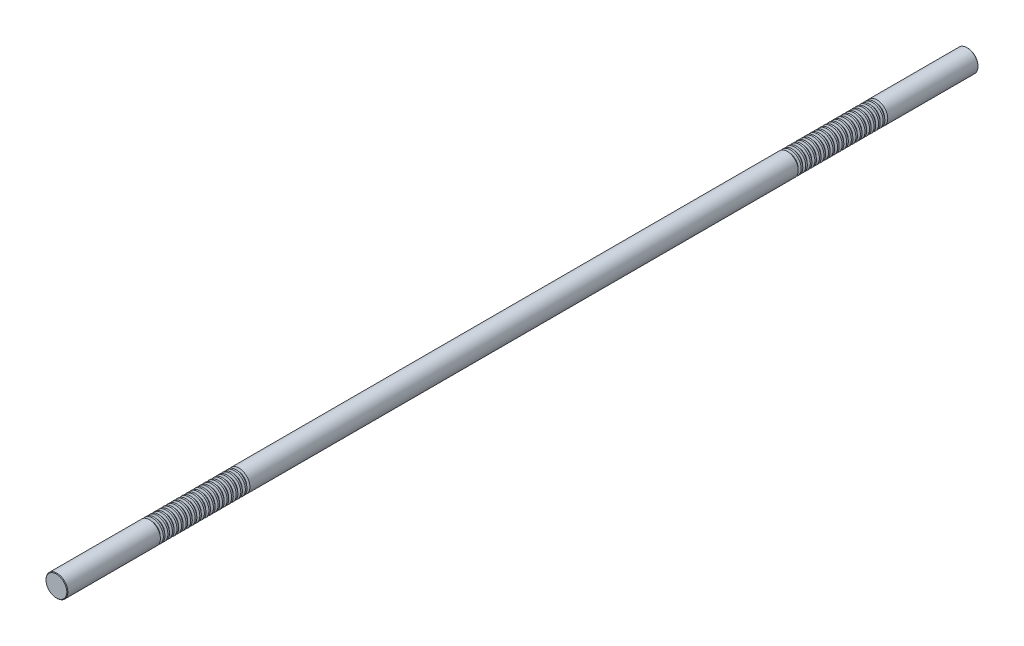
from build123d import *

# Parameters (mm, degrees)
SKETCH1_R           = 12
BOSS_EXTRUDE1_DEPTH = 500
CHAMFER1_SIZE       = 0.6
LPATTERN1_COUNT     = 20
LPATTERN1_PITCH     = 5
LPATTERN2_COUNT     = 2
LPATTERN2_PITCH     = 700


with BuildPart() as part:
    # Sketch1 → Boss-Extrude1 (new, symmetric)
    with BuildSketch(Plane.XY):
        Circle(SKETCH1_R)
    extrude(amount=BOSS_EXTRUDE1_DEPTH, both=True)

    # Chamfer1
    chamfer1_edges = [part.edges().sort_by_distance(p)[0] for p in [
        (-12, 0, -500),
        (-12, 0, 500),
    ]]
    chamfer(chamfer1_edges, length=CHAMFER1_SIZE)

    # Sketch2 → Cut-Revolve1 (revolve, cut)
    with BuildSketch(Plane(origin=(0, 0, 0), x_dir=(0, 0, -1), z_dir=(1, 0, 0)), mode=Mode.PRIVATE) as cut_revolve1_sk:
        Polygon((400.36843014, 12), (397.13156986, 12), (397.86843014, 9.25), (399.63156986, 9.25), align=None)
    cut_revolve1 = revolve(cut_revolve1_sk.sketch.rotate(Axis((0, 0, 500), (0, 0, -1)), 90), axis=Axis((0, 0, 500), (0, 0, -1)), mode=Mode.SUBTRACT)

    # LPattern1: Cut-Revolve1 ×20
    with Locations(*[(0, 0, i * LPATTERN1_PITCH) for i in range(1, LPATTERN1_COUNT)]):
        add(cut_revolve1, mode=Mode.SUBTRACT)

    # LPattern2: Cut-Revolve1 ×2
    with Locations(*[(0, 0, i * LPATTERN2_PITCH) for i in range(1, LPATTERN2_COUNT)]):
        add(cut_revolve1, mode=Mode.SUBTRACT)

    # LPattern2 copy 1 sketch → LPattern2 copy 1 (revolve, cut)
    with BuildSketch(Plane(origin=(0, 0, 705), x_dir=(0, 0, -1), z_dir=(1, 0, 0))):
        Polygon((400.36843014, 12), (397.13156986, 12), (397.86843014, 9.25), (399.63156986, 9.25), align=None)
    revolve(axis=Axis((0, 0, 1205), (0, 0, -1)), mode=Mode.SUBTRACT)

    # LPattern2 copy 2 sketch → LPattern2 copy 2 (revolve, cut)
    with BuildSketch(Plane(origin=(0, 0, 710), x_dir=(0, 0, -1), z_dir=(1, 0, 0))):
        Polygon((400.36843014, 12), (397.13156986, 12), (397.86843014, 9.25), (399.63156986, 9.25), align=None)
    revolve(axis=Axis((0, 0, 1210), (0, 0, -1)), mode=Mode.SUBTRACT)

    # LPattern2 copy 3 sketch → LPattern2 copy 3 (revolve, cut)
    with BuildSketch(Plane(origin=(0, 0, 715), x_dir=(0, 0, -1), z_dir=(1, 0, 0))):
        Polygon((400.36843014, 12), (397.13156986, 12), (397.86843014, 9.25), (399.63156986, 9.25), align=None)
    revolve(axis=Axis((0, 0, 1215), (0, 0, -1)), mode=Mode.SUBTRACT)

    # LPattern2 copy 4 sketch → LPattern2 copy 4 (revolve, cut)
    with BuildSketch(Plane(origin=(0, 0, 720), x_dir=(0, 0, -1), z_dir=(1, 0, 0))):
        Polygon((400.36843014, 12), (397.13156986, 12), (397.86843014, 9.25), (399.63156986, 9.25), align=None)
    revolve(axis=Axis((0, 0, 1220), (0, 0, -1)), mode=Mode.SUBTRACT)

    # LPattern2 copy 5 sketch → LPattern2 copy 5 (revolve, cut)
    with BuildSketch(Plane(origin=(0, 0, 725), x_dir=(0, 0, -1), z_dir=(1, 0, 0))):
        Polygon((400.36843014, 12), (397.13156986, 12), (397.86843014, 9.25), (399.63156986, 9.25), align=None)
    revolve(axis=Axis((0, 0, 1225), (0, 0, -1)), mode=Mode.SUBTRACT)

    # LPattern2 copy 6 sketch → LPattern2 copy 6 (revolve, cut)
    with BuildSketch(Plane(origin=(0, 0, 730), x_dir=(0, 0, -1), z_dir=(1, 0, 0))):
        Polygon((400.36843014, 12), (397.13156986, 12), (397.86843014, 9.25), (399.63156986, 9.25), align=None)
    revolve(axis=Axis((0, 0, 1230), (0, 0, -1)), mode=Mode.SUBTRACT)

    # LPattern2 copy 7 sketch → LPattern2 copy 7 (revolve, cut)
    with BuildSketch(Plane(origin=(0, 0, 735), x_dir=(0, 0, -1), z_dir=(1, 0, 0))):
        Polygon((400.36843014, 12), (397.13156986, 12), (397.86843014, 9.25), (399.63156986, 9.25), align=None)
    revolve(axis=Axis((0, 0, 1235), (0, 0, -1)), mode=Mode.SUBTRACT)

    # LPattern2 copy 8 sketch → LPattern2 copy 8 (revolve, cut)
    with BuildSketch(Plane(origin=(0, 0, 740), x_dir=(0, 0, -1), z_dir=(1, 0, 0))):
        Polygon((400.36843014, 12), (397.13156986, 12), (397.86843014, 9.25), (399.63156986, 9.25), align=None)
    revolve(axis=Axis((0, 0, 1240), (0, 0, -1)), mode=Mode.SUBTRACT)

    # LPattern2 copy 9 sketch → LPattern2 copy 9 (revolve, cut)
    with BuildSketch(Plane(origin=(0, 0, 745), x_dir=(0, 0, -1), z_dir=(1, 0, 0))):
        Polygon((400.36843014, 12), (397.13156986, 12), (397.86843014, 9.25), (399.63156986, 9.25), align=None)
    revolve(axis=Axis((0, 0, 1245), (0, 0, -1)), mode=Mode.SUBTRACT)

    # LPattern2 copy 10 sketch → LPattern2 copy 10 (revolve, cut)
    with BuildSketch(Plane(origin=(0, 0, 750), x_dir=(0, 0, -1), z_dir=(1, 0, 0))):
        Polygon((400.36843014, 12), (397.13156986, 12), (397.86843014, 9.25), (399.63156986, 9.25), align=None)
    revolve(axis=Axis((0, 0, 1250), (0, 0, -1)), mode=Mode.SUBTRACT)

    # LPattern2 copy 11 sketch → LPattern2 copy 11 (revolve, cut)
    with BuildSketch(Plane(origin=(0, 0, 755), x_dir=(0, 0, -1), z_dir=(1, 0, 0))):
        Polygon((400.36843014, 12), (397.13156986, 12), (397.86843014, 9.25), (399.63156986, 9.25), align=None)
    revolve(axis=Axis((0, 0, 1255), (0, 0, -1)), mode=Mode.SUBTRACT)

    # LPattern2 copy 12 sketch → LPattern2 copy 12 (revolve, cut)
    with BuildSketch(Plane(origin=(0, 0, 760), x_dir=(0, 0, -1), z_dir=(1, 0, 0))):
        Polygon((400.36843014, 12), (397.13156986, 12), (397.86843014, 9.25), (399.63156986, 9.25), align=None)
    revolve(axis=Axis((0, 0, 1260), (0, 0, -1)), mode=Mode.SUBTRACT)

    # LPattern2 copy 13 sketch → LPattern2 copy 13 (revolve, cut)
    with BuildSketch(Plane(origin=(0, 0, 765), x_dir=(0, 0, -1), z_dir=(1, 0, 0))):
        Polygon((400.36843014, 12), (397.13156986, 12), (397.86843014, 9.25), (399.63156986, 9.25), align=None)
    revolve(axis=Axis((0, 0, 1265), (0, 0, -1)), mode=Mode.SUBTRACT)

    # LPattern2 copy 14 sketch → LPattern2 copy 14 (revolve, cut)
    with BuildSketch(Plane(origin=(0, 0, 770), x_dir=(0, 0, -1), z_dir=(1, 0, 0))):
        Polygon((400.36843014, 12), (397.13156986, 12), (397.86843014, 9.25), (399.63156986, 9.25), align=None)
    revolve(axis=Axis((0, 0, 1270), (0, 0, -1)), mode=Mode.SUBTRACT)

    # LPattern2 copy 15 sketch → LPattern2 copy 15 (revolve, cut)
    with BuildSketch(Plane(origin=(0, 0, 775), x_dir=(0, 0, -1), z_dir=(1, 0, 0))):
        Polygon((400.36843014, 12), (397.13156986, 12), (397.86843014, 9.25), (399.63156986, 9.25), align=None)
    revolve(axis=Axis((0, 0, 1275), (0, 0, -1)), mode=Mode.SUBTRACT)

    # LPattern2 copy 16 sketch → LPattern2 copy 16 (revolve, cut)
    with BuildSketch(Plane(origin=(0, 0, 780), x_dir=(0, 0, -1), z_dir=(1, 0, 0))):
        Polygon((400.36843014, 12), (397.13156986, 12), (397.86843014, 9.25), (399.63156986, 9.25), align=None)
    revolve(axis=Axis((0, 0, 1280), (0, 0, -1)), mode=Mode.SUBTRACT)

    # LPattern2 copy 17 sketch → LPattern2 copy 17 (revolve, cut)
    with BuildSketch(Plane(origin=(0, 0, 785), x_dir=(0, 0, -1), z_dir=(1, 0, 0))):
        Polygon((400.36843014, 12), (397.13156986, 12), (397.86843014, 9.25), (399.63156986, 9.25), align=None)
    revolve(axis=Axis((0, 0, 1285), (0, 0, -1)), mode=Mode.SUBTRACT)

    # LPattern2 copy 18 sketch → LPattern2 copy 18 (revolve, cut)
    with BuildSketch(Plane(origin=(0, 0, 790), x_dir=(0, 0, -1), z_dir=(1, 0, 0))):
        Polygon((400.36843014, 12), (397.13156986, 12), (397.86843014, 9.25), (399.63156986, 9.25), align=None)
    revolve(axis=Axis((0, 0, 1290), (0, 0, -1)), mode=Mode.SUBTRACT)

    # LPattern2 copy 19 sketch → LPattern2 copy 19 (revolve, cut)
    with BuildSketch(Plane(origin=(0, 0, 795), x_dir=(0, 0, -1), z_dir=(1, 0, 0))):
        Polygon((400.36843014, 12), (397.13156986, 12), (397.86843014, 9.25), (399.63156986, 9.25), align=None)
    revolve(axis=Axis((0, 0, 1295), (0, 0, -1)), mode=Mode.SUBTRACT)


solid = part.part
